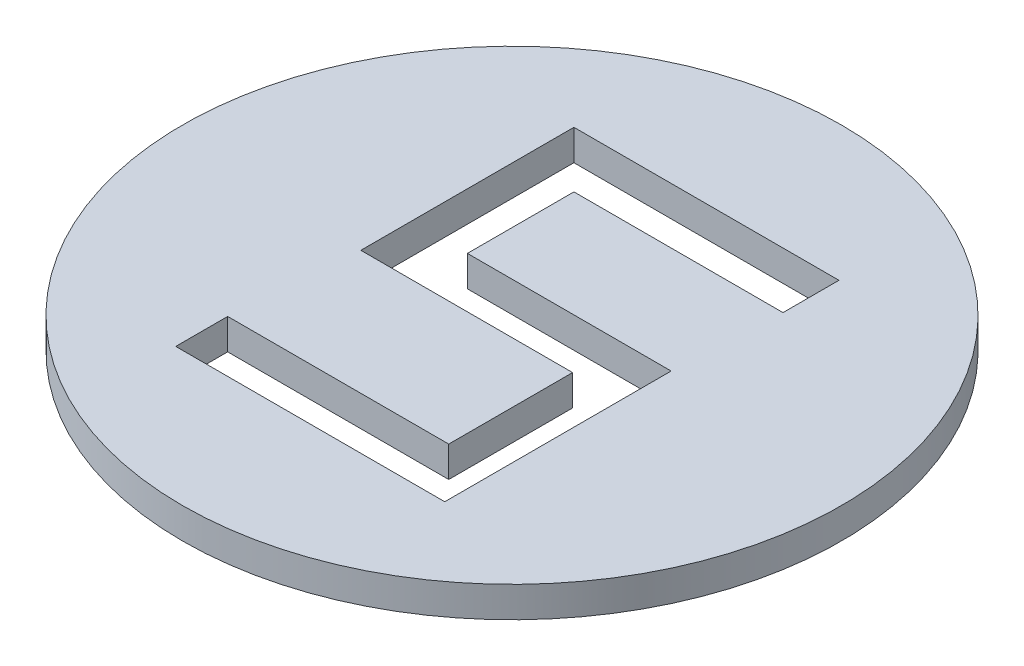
from build123d import *

# Parameters (mm, degrees)
SKETCH1_R           = 42.939529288
BOSS_EXTRUDE1_DEPTH = 4
CUT_EXTRUDE1_DEPTH  = 4


with BuildPart() as part:
    # Sketch1 → Boss-Extrude1 (new body)
    with BuildSketch(Plane(origin=(0, 0, 0), x_dir=(1, 0, 0), z_dir=(0, 1, 0))):
        with Locations(Location((0, 7.7315476, 0), (0, 0, 270))):
            Circle(SKETCH1_R)
    extrude(amount=BOSS_EXTRUDE1_DEPTH)

    # Sketch2 → Cut-Extrude1 (cut)
    with BuildSketch(Plane(origin=(0, 4, 0), x_dir=(1, 0, 0), z_dir=(0, 1, 0))):
        Polygon((17.351780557, 32.978388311), (-17.178262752, 32.978388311), (-17.178262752, 5.21553942), (10.411068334, 5.21553942), (10.411068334, -10.921616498), (-18.392887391, -10.921616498), (-18.392887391, -17.688810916), (16.657709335, -17.688810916), (16.657709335, 11.809216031), (-9.890514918, 11.809216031), (-9.890514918, 25.690640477), (17.351780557, 25.690640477), align=None)
    extrude(amount=-CUT_EXTRUDE1_DEPTH, mode=Mode.SUBTRACT)


solid = part.part
